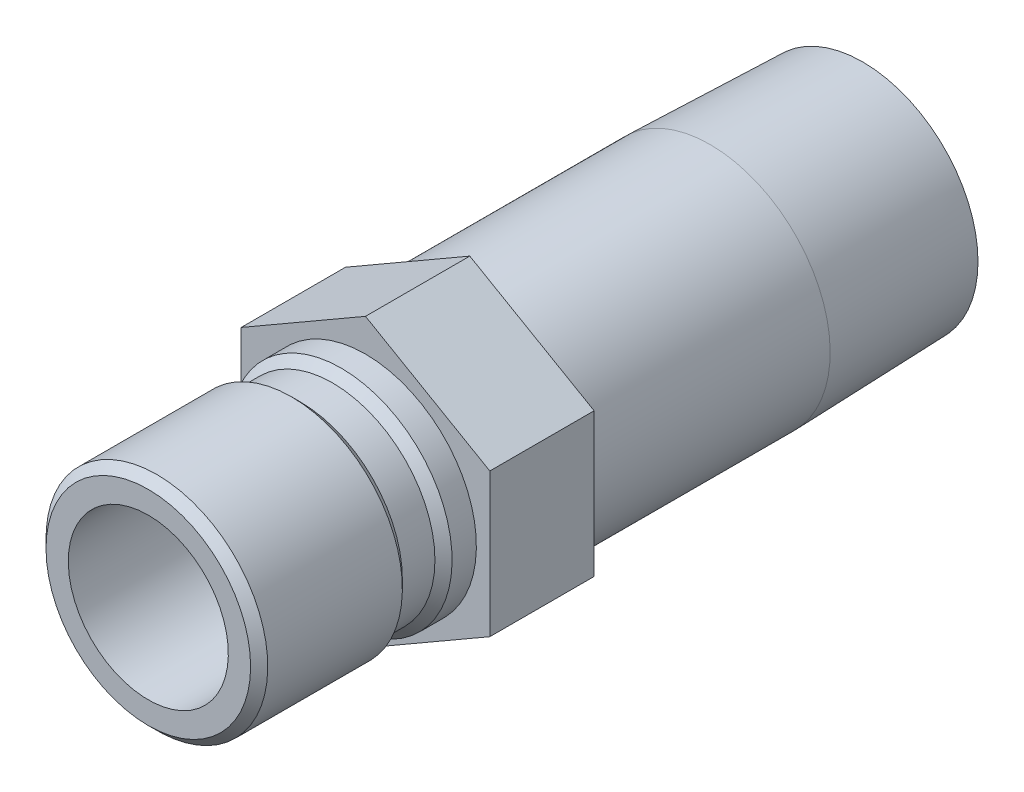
ISO-10303-21;
HEADER;
FILE_DESCRIPTION(('STEP AP214'),'2;1');
FILE_NAME('part.step','',(''),(''),'','','');
FILE_SCHEMA(('AUTOMOTIVE_DESIGN { 1 0 10303 214 1 1 1 1 }'));
ENDSEC;
DATA;
#1=APPLICATION_CONTEXT('core data for automotive mechanical design processes');
#2=APPLICATION_PROTOCOL_DEFINITION('international standard','automotive_design',2000,#1);
#3=PRODUCT_CONTEXT('',#1,'mechanical');
#4=PRODUCT('Part','Part','',(#3));
#5=PRODUCT_RELATED_PRODUCT_CATEGORY('part','',(#4));
#6=PRODUCT_DEFINITION_FORMATION('','',#4);
#7=PRODUCT_DEFINITION_CONTEXT('part definition',#1,'design');
#8=PRODUCT_DEFINITION('design','',#6,#7);
#9=PRODUCT_DEFINITION_SHAPE('','',#8);
#10=(LENGTH_UNIT() NAMED_UNIT(*) SI_UNIT(.MILLI.,.METRE.));
#11=(NAMED_UNIT(*) PLANE_ANGLE_UNIT() SI_UNIT($,.RADIAN.));
#12=(NAMED_UNIT(*) SI_UNIT($,.STERADIAN.) SOLID_ANGLE_UNIT());
#13=UNCERTAINTY_MEASURE_WITH_UNIT(LENGTH_MEASURE(1.E-05),#10,'distance_accuracy_value','');
#14=(GEOMETRIC_REPRESENTATION_CONTEXT(3) GLOBAL_UNCERTAINTY_ASSIGNED_CONTEXT((#13)) GLOBAL_UNIT_ASSIGNED_CONTEXT((#10,
#11,#12)) REPRESENTATION_CONTEXT('',''));
#15=CARTESIAN_POINT('',(0.,0.,0.));
#16=DIRECTION('',(0.,0.,1.));
#17=DIRECTION('',(1.,0.,0.));
#18=AXIS2_PLACEMENT_3D('',#15,#16,#17);
#19=CARTESIAN_POINT('',(0.,0.,0.));
#20=DIRECTION('',(0.,0.,-1.));
#21=DIRECTION('',(0.,1.,0.));
#22=AXIS2_PLACEMENT_3D('',#19,#20,#21);
#23=CYLINDRICAL_SURFACE('',#22,7.112);
#24=CARTESIAN_POINT('',(0.,0.,1.524));
#25=DIRECTION('',(0.,0.,-1.));
#26=DIRECTION('',(0.,1.,0.));
#27=AXIS2_PLACEMENT_3D('',#24,#25,#26);
#28=CIRCLE('',#27,7.112);
#29=CARTESIAN_POINT('',(0.,7.112,1.524));
#30=VERTEX_POINT('',#29);
#31=EDGE_CURVE('E147',#30,#30,#28,.T.);
#32=ORIENTED_EDGE('',*,*,#31,.T.);
#33=EDGE_LOOP('',(#32));
#34=FACE_BOUND('',#33,.T.);
#35=CARTESIAN_POINT('',(0.,0.,19.304));
#36=DIRECTION('',(0.,0.,-1.));
#37=DIRECTION('',(0.,1.,0.));
#38=AXIS2_PLACEMENT_3D('',#35,#36,#37);
#39=CIRCLE('',#38,7.112);
#40=CARTESIAN_POINT('',(0.,7.112,19.304));
#41=VERTEX_POINT('',#40);
#42=EDGE_CURVE('E42',#41,#41,#39,.T.);
#43=ORIENTED_EDGE('',*,*,#42,.F.);
#44=EDGE_LOOP('',(#43));
#45=FACE_BOUND('',#44,.T.);
#46=ADVANCED_FACE('F33',(#34,#45),#23,.F.);
#47=CARTESIAN_POINT('',(0.,7.112,19.304));
#48=DIRECTION('',(0.,0.,1.));
#49=DIRECTION('',(0.,-1.,0.));
#50=AXIS2_PLACEMENT_3D('',#47,#48,#49);
#51=PLANE('',#50);
#52=ORIENTED_EDGE('',*,*,#42,.T.);
#53=EDGE_LOOP('',(#52));
#54=FACE_BOUND('',#53,.T.);
#55=CARTESIAN_POINT('',(0.,0.,19.304));
#56=DIRECTION('',(0.,0.,-1.));
#57=DIRECTION('',(0.,1.,0.));
#58=AXIS2_PLACEMENT_3D('',#55,#56,#57);
#59=CIRCLE('',#58,9.0932);
#60=CARTESIAN_POINT('',(0.,9.0932,19.304));
#61=VERTEX_POINT('',#60);
#62=EDGE_CURVE('E180',#61,#61,#59,.T.);
#63=ORIENTED_EDGE('',*,*,#62,.F.);
#64=EDGE_LOOP('',(#63));
#65=FACE_BOUND('',#64,.T.);
#66=ADVANCED_FACE('F186',(#54,#65),#51,.T.);
#67=CARTESIAN_POINT('',(0.,0.,18.542));
#68=DIRECTION('',(0.,0.,-1.));
#69=DIRECTION('',(0.,1.,0.));
#70=AXIS2_PLACEMENT_3D('',#67,#68,#69);
#71=CONICAL_SURFACE('',#70,9.8552,0.785398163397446);
#72=ORIENTED_EDGE('',*,*,#62,.T.);
#73=EDGE_LOOP('',(#72));
#74=FACE_BOUND('',#73,.T.);
#75=CARTESIAN_POINT('',(0.,0.,18.542));
#76=DIRECTION('',(0.,0.,-1.));
#77=DIRECTION('',(0.,1.,0.));
#78=AXIS2_PLACEMENT_3D('',#75,#76,#77);
#79=CIRCLE('',#78,9.8552);
#80=CARTESIAN_POINT('',(0.,9.8552,18.542));
#81=VERTEX_POINT('',#80);
#82=EDGE_CURVE('E177',#81,#81,#79,.T.);
#83=ORIENTED_EDGE('',*,*,#82,.F.);
#84=EDGE_LOOP('',(#83));
#85=FACE_BOUND('',#84,.T.);
#86=ADVANCED_FACE('F194',(#74,#85),#71,.T.);
#87=CARTESIAN_POINT('',(0.,0.,0.));
#88=DIRECTION('',(0.,0.,-1.));
#89=DIRECTION('',(0.,1.,0.));
#90=AXIS2_PLACEMENT_3D('',#87,#88,#89);
#91=CYLINDRICAL_SURFACE('',#90,9.8552);
#92=ORIENTED_EDGE('',*,*,#82,.T.);
#93=EDGE_LOOP('',(#92));
#94=FACE_BOUND('',#93,.T.);
#95=CARTESIAN_POINT('',(0.,0.,6.5786));
#96=DIRECTION('',(0.,0.,-1.));
#97=DIRECTION('',(0.,1.,0.));
#98=AXIS2_PLACEMENT_3D('',#95,#96,#97);
#99=CIRCLE('',#98,9.8552);
#100=CARTESIAN_POINT('',(0.,9.8552,6.5786));
#101=VERTEX_POINT('',#100);
#102=EDGE_CURVE('E174',#101,#101,#99,.T.);
#103=ORIENTED_EDGE('',*,*,#102,.F.);
#104=EDGE_LOOP('',(#103));
#105=FACE_BOUND('',#104,.T.);
#106=ADVANCED_FACE('F249',(#94,#105),#91,.T.);
#107=CARTESIAN_POINT('',(0.,0.,5.8166));
#108=DIRECTION('',(0.,0.,1.));
#109=DIRECTION('',(0.,-1.,0.));
#110=AXIS2_PLACEMENT_3D('',#107,#108,#109);
#111=CONICAL_SURFACE('',#110,9.0932,0.785398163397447);
#112=ORIENTED_EDGE('',*,*,#102,.T.);
#113=EDGE_LOOP('',(#112));
#114=FACE_BOUND('',#113,.T.);
#115=CARTESIAN_POINT('',(0.,0.,5.8166));
#116=DIRECTION('',(0.,0.,-1.));
#117=DIRECTION('',(0.,1.,0.));
#118=AXIS2_PLACEMENT_3D('',#115,#116,#117);
#119=CIRCLE('',#118,9.0932);
#120=CARTESIAN_POINT('',(0.,9.0932,5.8166));
#121=VERTEX_POINT('',#120);
#122=EDGE_CURVE('E171',#121,#121,#119,.T.);
#123=ORIENTED_EDGE('',*,*,#122,.F.);
#124=EDGE_LOOP('',(#123));
#125=FACE_BOUND('',#124,.T.);
#126=ADVANCED_FACE('F245',(#114,#125),#111,.T.);
#127=CARTESIAN_POINT('',(0.,0.,0.));
#128=DIRECTION('',(0.,0.,-1.));
#129=DIRECTION('',(0.,1.,0.));
#130=AXIS2_PLACEMENT_3D('',#127,#128,#129);
#131=CYLINDRICAL_SURFACE('',#130,9.0932);
#132=ORIENTED_EDGE('',*,*,#122,.T.);
#133=EDGE_LOOP('',(#132));
#134=FACE_BOUND('',#133,.T.);
#135=CARTESIAN_POINT('',(0.,0.,2.921));
#136=DIRECTION('',(0.,0.,-1.));
#137=DIRECTION('',(0.,1.,0.));
#138=AXIS2_PLACEMENT_3D('',#135,#136,#137);
#139=CIRCLE('',#138,9.0932);
#140=CARTESIAN_POINT('',(0.,9.0932,2.921));
#141=VERTEX_POINT('',#140);
#142=EDGE_CURVE('E168',#141,#141,#139,.T.);
#143=ORIENTED_EDGE('',*,*,#142,.F.);
#144=EDGE_LOOP('',(#143));
#145=FACE_BOUND('',#144,.T.);
#146=ADVANCED_FACE('F241',(#134,#145),#131,.T.);
#147=CARTESIAN_POINT('',(0.,0.,2.159));
#148=DIRECTION('',(0.,0.,-1.));
#149=DIRECTION('',(0.,1.,0.));
#150=AXIS2_PLACEMENT_3D('',#147,#148,#149);
#151=CONICAL_SURFACE('',#150,9.8552,0.785398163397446);
#152=ORIENTED_EDGE('',*,*,#142,.T.);
#153=EDGE_LOOP('',(#152));
#154=FACE_BOUND('',#153,.T.);
#155=CARTESIAN_POINT('',(0.,0.,2.159));
#156=DIRECTION('',(0.,0.,-1.));
#157=DIRECTION('',(0.,1.,0.));
#158=AXIS2_PLACEMENT_3D('',#155,#156,#157);
#159=CIRCLE('',#158,9.8552);
#160=CARTESIAN_POINT('',(0.,9.8552,2.159));
#161=VERTEX_POINT('',#160);
#162=EDGE_CURVE('E165',#161,#161,#159,.T.);
#163=ORIENTED_EDGE('',*,*,#162,.F.);
#164=EDGE_LOOP('',(#163));
#165=FACE_BOUND('',#164,.T.);
#166=ADVANCED_FACE('F237',(#154,#165),#151,.T.);
#167=CARTESIAN_POINT('',(0.,0.,0.));
#168=DIRECTION('',(0.,0.,-1.));
#169=DIRECTION('',(0.,1.,0.));
#170=AXIS2_PLACEMENT_3D('',#167,#168,#169);
#171=CYLINDRICAL_SURFACE('',#170,9.8552);
#172=ORIENTED_EDGE('',*,*,#162,.T.);
#173=EDGE_LOOP('',(#172));
#174=FACE_BOUND('',#173,.T.);
#175=CARTESIAN_POINT('',(0.,0.,0.));
#176=DIRECTION('',(0.,0.,-1.));
#177=DIRECTION('',(0.,1.,0.));
#178=AXIS2_PLACEMENT_3D('',#175,#176,#177);
#179=CIRCLE('',#178,9.8552);
#180=CARTESIAN_POINT('',(0.,9.8552,0.));
#181=VERTEX_POINT('',#180);
#182=EDGE_CURVE('E162',#181,#181,#179,.T.);
#183=ORIENTED_EDGE('',*,*,#182,.F.);
#184=EDGE_LOOP('',(#183));
#185=FACE_BOUND('',#184,.T.);
#186=ADVANCED_FACE('F233',(#174,#185),#171,.T.);
#187=CARTESIAN_POINT('',(0.,9.8552,0.));
#188=DIRECTION('',(0.,0.,1.));
#189=DIRECTION('',(0.,-1.,0.));
#190=AXIS2_PLACEMENT_3D('',#187,#188,#189);
#191=PLANE('',#190);
#192=ORIENTED_EDGE('',*,*,#182,.T.);
#193=EDGE_LOOP('',(#192));
#194=FACE_BOUND('',#193,.T.);
#195=DIRECTION('',(-0.866025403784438,-0.5,0.));
#196=VECTOR('',#195,1.);
#197=CARTESIAN_POINT('',(0.,12.7582862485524,0.));
#198=LINE('',#197,#196);
#199=CARTESIAN_POINT('',(0.,12.7582862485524,0.));
#200=VERTEX_POINT('',#199);
#201=CARTESIAN_POINT('',(-11.049,6.37914312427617,0.));
#202=VERTEX_POINT('',#201);
#203=EDGE_CURVE('E121',#200,#202,#198,.T.);
#204=ORIENTED_EDGE('',*,*,#203,.T.);
#205=DIRECTION('',(0.,-1.,0.));
#206=VECTOR('',#205,1.);
#207=CARTESIAN_POINT('',(-11.049,6.37914312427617,0.));
#208=LINE('',#207,#206);
#209=CARTESIAN_POINT('',(-11.049,-6.37914312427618,0.));
#210=VERTEX_POINT('',#209);
#211=EDGE_CURVE('E124',#202,#210,#208,.T.);
#212=ORIENTED_EDGE('',*,*,#211,.T.);
#213=DIRECTION('',(0.866025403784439,-0.5,0.));
#214=VECTOR('',#213,1.);
#215=CARTESIAN_POINT('',(-11.049,-6.37914312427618,0.));
#216=LINE('',#215,#214);
#217=CARTESIAN_POINT('',(0.,-12.7582862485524,0.));
#218=VERTEX_POINT('',#217);
#219=EDGE_CURVE('E128',#210,#218,#216,.T.);
#220=ORIENTED_EDGE('',*,*,#219,.T.);
#221=DIRECTION('',(0.866025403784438,0.5,0.));
#222=VECTOR('',#221,1.);
#223=CARTESIAN_POINT('',(0.,-12.7582862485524,0.));
#224=LINE('',#223,#222);
#225=CARTESIAN_POINT('',(11.049,-6.37914312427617,0.));
#226=VERTEX_POINT('',#225);
#227=EDGE_CURVE('E131',#218,#226,#224,.T.);
#228=ORIENTED_EDGE('',*,*,#227,.T.);
#229=DIRECTION('',(0.,1.,0.));
#230=VECTOR('',#229,1.);
#231=CARTESIAN_POINT('',(11.049,-6.37914312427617,0.));
#232=LINE('',#231,#230);
#233=CARTESIAN_POINT('',(11.049,6.37914312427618,0.));
#234=VERTEX_POINT('',#233);
#235=EDGE_CURVE('E98',#226,#234,#232,.T.);
#236=ORIENTED_EDGE('',*,*,#235,.T.);
#237=DIRECTION('',(-0.866025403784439,0.5,0.));
#238=VECTOR('',#237,1.);
#239=CARTESIAN_POINT('',(11.049,6.37914312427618,0.));
#240=LINE('',#239,#238);
#241=EDGE_CURVE('E134',#234,#200,#240,.T.);
#242=ORIENTED_EDGE('',*,*,#241,.T.);
#243=EDGE_LOOP('',(#204,#212,#220,#228,#236,#242));
#244=FACE_BOUND('',#243,.T.);
#245=ADVANCED_FACE('F210',(#194,#244),#191,.T.);
#246=CARTESIAN_POINT('',(0.,0.,0.));
#247=DIRECTION('',(0.,0.,-1.));
#248=DIRECTION('',(0.,1.,0.));
#249=AXIS2_PLACEMENT_3D('',#246,#247,#248);
#250=CYLINDRICAL_SURFACE('',#249,7.8994);
#251=CARTESIAN_POINT('',(0.,0.,0.));
#252=DIRECTION('',(0.,0.,1.));
#253=DIRECTION('',(1.,0.,0.));
#254=AXIS2_PLACEMENT_3D('',#251,#252,#253);
#255=CIRCLE('',#254,7.8994);
#256=CARTESIAN_POINT('',(7.8994,0.,0.));
#257=VERTEX_POINT('',#256);
#258=EDGE_CURVE('E11',#257,#257,#255,.T.);
#259=ORIENTED_EDGE('',*,*,#258,.F.);
#260=EDGE_LOOP('',(#259));
#261=FACE_BOUND('',#260,.T.);
#262=CARTESIAN_POINT('',(0.,0.,1.10533199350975));
#263=DIRECTION('',(0.,0.,-1.));
#264=DIRECTION('',(0.,1.,0.));
#265=AXIS2_PLACEMENT_3D('',#262,#263,#264);
#266=CIRCLE('',#265,7.8994);
#267=CARTESIAN_POINT('',(0.,7.8994,1.10533199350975));
#268=VERTEX_POINT('',#267);
#269=EDGE_CURVE('E150',#268,#268,#266,.T.);
#270=ORIENTED_EDGE('',*,*,#269,.F.);
#271=EDGE_LOOP('',(#270));
#272=FACE_BOUND('',#271,.T.);
#273=ADVANCED_FACE('F200',(#261,#272),#250,.F.);
#274=CARTESIAN_POINT('',(0.,0.,1.524));
#275=DIRECTION('',(0.,0.,-1.));
#276=DIRECTION('',(0.,1.,0.));
#277=AXIS2_PLACEMENT_3D('',#274,#275,#276);
#278=CONICAL_SURFACE('',#277,7.112,1.08210413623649);
#279=ORIENTED_EDGE('',*,*,#269,.T.);
#280=EDGE_LOOP('',(#279));
#281=FACE_BOUND('',#280,.T.);
#282=ORIENTED_EDGE('',*,*,#31,.F.);
#283=EDGE_LOOP('',(#282));
#284=FACE_BOUND('',#283,.T.);
#285=ADVANCED_FACE('F197',(#281,#284),#278,.F.);
#286=CARTESIAN_POINT('',(-11.049,6.37914312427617,-9.271));
#287=DIRECTION('',(0.,0.,1.));
#288=DIRECTION('',(1.,0.,0.));
#289=AXIS2_PLACEMENT_3D('',#286,#287,#288);
#290=PLANE('',#289);
#291=CARTESIAN_POINT('',(0.,0.,-9.271));
#292=DIRECTION('',(0.,0.,1.));
#293=DIRECTION('',(1.,0.,0.));
#294=AXIS2_PLACEMENT_3D('',#291,#292,#293);
#295=CIRCLE('',#294,7.8994);
#296=CARTESIAN_POINT('',(7.8994,0.,-9.271));
#297=VERTEX_POINT('',#296);
#298=EDGE_CURVE('E36',#297,#297,#295,.T.);
#299=ORIENTED_EDGE('',*,*,#298,.F.);
#300=EDGE_LOOP('',(#299));
#301=FACE_BOUND('',#300,.T.);
#302=CARTESIAN_POINT('',(0.,0.,-9.271));
#303=DIRECTION('',(0.,0.,1.));
#304=DIRECTION('',(1.,0.,0.));
#305=AXIS2_PLACEMENT_3D('',#302,#303,#304);
#306=CIRCLE('',#305,7.112);
#307=CARTESIAN_POINT('',(7.112,0.,-9.271));
#308=VERTEX_POINT('',#307);
#309=EDGE_CURVE('E125',#308,#308,#306,.T.);
#310=ORIENTED_EDGE('',*,*,#309,.T.);
#311=EDGE_LOOP('',(#310));
#312=FACE_BOUND('',#311,.T.);
#313=ADVANCED_FACE('F199',(#301,#312),#290,.F.);
#314=CARTESIAN_POINT('',(0.,0.,-9.271));
#315=DIRECTION('',(0.,0.,1.));
#316=DIRECTION('',(1.,0.,0.));
#317=AXIS2_PLACEMENT_3D('',#314,#315,#316);
#318=CYLINDRICAL_SURFACE('',#317,7.112);
#319=ORIENTED_EDGE('',*,*,#309,.F.);
#320=EDGE_LOOP('',(#319));
#321=FACE_BOUND('',#320,.T.);
#322=CARTESIAN_POINT('',(0.,0.,0.));
#323=DIRECTION('',(0.,0.,1.));
#324=DIRECTION('',(1.,0.,0.));
#325=AXIS2_PLACEMENT_3D('',#322,#323,#324);
#326=CIRCLE('',#325,7.112);
#327=CARTESIAN_POINT('',(7.112,0.,0.));
#328=VERTEX_POINT('',#327);
#329=EDGE_CURVE('E443',#328,#328,#326,.T.);
#330=ORIENTED_EDGE('',*,*,#329,.T.);
#331=EDGE_LOOP('',(#330));
#332=FACE_BOUND('',#331,.T.);
#333=ADVANCED_FACE('F207',(#321,#332),#318,.F.);
#334=CARTESIAN_POINT('',(-11.049,6.37914312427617,0.));
#335=DIRECTION('',(0.,0.,1.));
#336=DIRECTION('',(1.,0.,0.));
#337=AXIS2_PLACEMENT_3D('',#334,#335,#336);
#338=PLANE('',#337);
#339=ORIENTED_EDGE('',*,*,#258,.T.);
#340=EDGE_LOOP('',(#339));
#341=FACE_BOUND('',#340,.T.);
#342=ORIENTED_EDGE('',*,*,#329,.F.);
#343=EDGE_LOOP('',(#342));
#344=FACE_BOUND('',#343,.T.);
#345=ADVANCED_FACE('F221',(#341,#344),#338,.T.);
#346=CARTESIAN_POINT('',(0.,10.244140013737,-44.196));
#347=DIRECTION('',(0.,0.,-1.));
#348=DIRECTION('',(0.,1.,0.));
#349=AXIS2_PLACEMENT_3D('',#346,#347,#348);
#350=PLANE('',#349);
#351=CARTESIAN_POINT('',(0.,0.,-44.196));
#352=DIRECTION('',(0.,0.,-1.));
#353=DIRECTION('',(0.,1.,0.));
#354=AXIS2_PLACEMENT_3D('',#351,#352,#353);
#355=CIRCLE('',#354,10.244140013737);
#356=CARTESIAN_POINT('',(0.,10.244140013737,-44.196));
#357=VERTEX_POINT('',#356);
#358=EDGE_CURVE('E156',#357,#357,#355,.T.);
#359=ORIENTED_EDGE('',*,*,#358,.T.);
#360=EDGE_LOOP('',(#359));
#361=FACE_BOUND('',#360,.T.);
#362=CARTESIAN_POINT('',(0.,0.,-44.196));
#363=DIRECTION('',(0.,0.,-1.));
#364=DIRECTION('',(0.,1.,0.));
#365=AXIS2_PLACEMENT_3D('',#362,#363,#364);
#366=CIRCLE('',#365,7.89939999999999);
#367=CARTESIAN_POINT('',(0.,7.8994,-44.196));
#368=VERTEX_POINT('',#367);
#369=EDGE_CURVE('E153',#368,#368,#366,.T.);
#370=ORIENTED_EDGE('',*,*,#369,.F.);
#371=EDGE_LOOP('',(#370));
#372=FACE_BOUND('',#371,.T.);
#373=ADVANCED_FACE('F218',(#361,#372),#350,.T.);
#374=ORIENTED_EDGE('',*,*,#369,.T.);
#375=EDGE_LOOP('',(#374));
#376=FACE_BOUND('',#375,.T.);
#377=ORIENTED_EDGE('',*,*,#298,.T.);
#378=EDGE_LOOP('',(#377));
#379=FACE_BOUND('',#378,.T.);
#380=ADVANCED_FACE('F213',(#376,#379),#250,.F.);
#381=CARTESIAN_POINT('',(0.,0.,-44.196));
#382=DIRECTION('',(0.,0.,1.));
#383=DIRECTION('',(0.,-1.,0.));
#384=AXIS2_PLACEMENT_3D('',#381,#382,#383);
#385=CONICAL_SURFACE('',#384,10.244140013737,0.0312396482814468);
#386=CARTESIAN_POINT('',(0.,0.,-30.6324));
#387=DIRECTION('',(0.,0.,-1.));
#388=DIRECTION('',(0.,1.,0.));
#389=AXIS2_PLACEMENT_3D('',#386,#387,#388);
#390=CIRCLE('',#389,10.668);
#391=CARTESIAN_POINT('',(0.,10.668,-30.6324));
#392=VERTEX_POINT('',#391);
#393=EDGE_CURVE('E159',#392,#392,#390,.T.);
#394=ORIENTED_EDGE('',*,*,#393,.T.);
#395=EDGE_LOOP('',(#394));
#396=FACE_BOUND('',#395,.T.);
#397=ORIENTED_EDGE('',*,*,#358,.F.);
#398=EDGE_LOOP('',(#397));
#399=FACE_BOUND('',#398,.T.);
#400=ADVANCED_FACE('F223',(#396,#399),#385,.T.);
#401=CARTESIAN_POINT('',(0.,0.,0.));
#402=DIRECTION('',(0.,0.,-1.));
#403=DIRECTION('',(0.,1.,0.));
#404=AXIS2_PLACEMENT_3D('',#401,#402,#403);
#405=CYLINDRICAL_SURFACE('',#404,10.668);
#406=ORIENTED_EDGE('',*,*,#393,.F.);
#407=EDGE_LOOP('',(#406));
#408=FACE_BOUND('',#407,.T.);
#409=CARTESIAN_POINT('',(0.,0.,-9.271));
#410=DIRECTION('',(0.,0.,1.));
#411=DIRECTION('',(1.,0.,0.));
#412=AXIS2_PLACEMENT_3D('',#409,#410,#411);
#413=CIRCLE('',#412,10.668);
#414=CARTESIAN_POINT('',(10.668,0.,-9.271));
#415=VERTEX_POINT('',#414);
#416=EDGE_CURVE('E144',#415,#415,#413,.F.);
#417=ORIENTED_EDGE('',*,*,#416,.T.);
#418=EDGE_LOOP('',(#417));
#419=FACE_BOUND('',#418,.T.);
#420=ADVANCED_FACE('F226',(#408,#419),#405,.T.);
#421=ORIENTED_EDGE('',*,*,#416,.F.);
#422=EDGE_LOOP('',(#421));
#423=FACE_BOUND('',#422,.T.);
#424=DIRECTION('',(-0.866025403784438,-0.5,0.));
#425=VECTOR('',#424,1.);
#426=CARTESIAN_POINT('',(0.,12.7582862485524,-9.271));
#427=LINE('',#426,#425);
#428=CARTESIAN_POINT('',(0.,12.7582862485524,-9.271));
#429=VERTEX_POINT('',#428);
#430=CARTESIAN_POINT('',(-11.049,6.37914312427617,-9.271));
#431=VERTEX_POINT('',#430);
#432=EDGE_CURVE('E137',#429,#431,#427,.T.);
#433=ORIENTED_EDGE('',*,*,#432,.F.);
#434=DIRECTION('',(-0.866025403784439,0.5,0.));
#435=VECTOR('',#434,1.);
#436=CARTESIAN_POINT('',(11.049,6.37914312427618,-9.271));
#437=LINE('',#436,#435);
#438=CARTESIAN_POINT('',(11.049,6.37914312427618,-9.271));
#439=VERTEX_POINT('',#438);
#440=EDGE_CURVE('E111',#439,#429,#437,.T.);
#441=ORIENTED_EDGE('',*,*,#440,.F.);
#442=DIRECTION('',(0.,1.,0.));
#443=VECTOR('',#442,1.);
#444=CARTESIAN_POINT('',(11.049,-6.37914312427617,-9.271));
#445=LINE('',#444,#443);
#446=CARTESIAN_POINT('',(11.049,-6.37914312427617,-9.271));
#447=VERTEX_POINT('',#446);
#448=EDGE_CURVE('E96',#447,#439,#445,.T.);
#449=ORIENTED_EDGE('',*,*,#448,.F.);
#450=DIRECTION('',(0.866025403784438,0.5,0.));
#451=VECTOR('',#450,1.);
#452=CARTESIAN_POINT('',(0.,-12.7582862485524,-9.271));
#453=LINE('',#452,#451);
#454=CARTESIAN_POINT('',(0.,-12.7582862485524,-9.271));
#455=VERTEX_POINT('',#454);
#456=EDGE_CURVE('E109',#455,#447,#453,.T.);
#457=ORIENTED_EDGE('',*,*,#456,.F.);
#458=DIRECTION('',(0.866025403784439,-0.5,0.));
#459=VECTOR('',#458,1.);
#460=CARTESIAN_POINT('',(-11.049,-6.37914312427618,-9.271));
#461=LINE('',#460,#459);
#462=CARTESIAN_POINT('',(-11.049,-6.37914312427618,-9.271));
#463=VERTEX_POINT('',#462);
#464=EDGE_CURVE('E114',#463,#455,#461,.T.);
#465=ORIENTED_EDGE('',*,*,#464,.F.);
#466=DIRECTION('',(0.,-1.,0.));
#467=VECTOR('',#466,1.);
#468=CARTESIAN_POINT('',(-11.049,6.37914312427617,-9.271));
#469=LINE('',#468,#467);
#470=EDGE_CURVE('E116',#431,#463,#469,.T.);
#471=ORIENTED_EDGE('',*,*,#470,.F.);
#472=EDGE_LOOP('',(#433,#441,#449,#457,#465,#471));
#473=FACE_BOUND('',#472,.T.);
#474=ADVANCED_FACE('F107',(#423,#473),#290,.F.);
#475=CARTESIAN_POINT('',(0.,12.7582862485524,-9.271));
#476=DIRECTION('',(-0.5,0.866025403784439,0.));
#477=DIRECTION('',(-0.866025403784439,-0.5,0.));
#478=AXIS2_PLACEMENT_3D('',#475,#476,#477);
#479=PLANE('',#478);
#480=ORIENTED_EDGE('',*,*,#203,.F.);
#481=DIRECTION('',(0.,0.,1.));
#482=VECTOR('',#481,1.);
#483=CARTESIAN_POINT('',(0.,12.7582862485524,-9.271));
#484=LINE('',#483,#482);
#485=EDGE_CURVE('E50',#429,#200,#484,.T.);
#486=ORIENTED_EDGE('',*,*,#485,.F.);
#487=ORIENTED_EDGE('',*,*,#432,.T.);
#488=DIRECTION('',(0.,0.,1.));
#489=VECTOR('',#488,1.);
#490=CARTESIAN_POINT('',(-11.049,6.37914312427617,-9.271));
#491=LINE('',#490,#489);
#492=EDGE_CURVE('E85',#431,#202,#491,.T.);
#493=ORIENTED_EDGE('',*,*,#492,.T.);
#494=EDGE_LOOP('',(#480,#486,#487,#493));
#495=FACE_BOUND('',#494,.T.);
#496=ADVANCED_FACE('F215',(#495),#479,.T.);
#497=CARTESIAN_POINT('',(11.049,6.37914312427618,-9.271));
#498=DIRECTION('',(0.5,0.866025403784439,0.));
#499=DIRECTION('',(-0.866025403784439,0.5,0.));
#500=AXIS2_PLACEMENT_3D('',#497,#498,#499);
#501=PLANE('',#500);
#502=ORIENTED_EDGE('',*,*,#241,.F.);
#503=DIRECTION('',(0.,0.,1.));
#504=VECTOR('',#503,1.);
#505=CARTESIAN_POINT('',(11.049,6.37914312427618,-9.271));
#506=LINE('',#505,#504);
#507=EDGE_CURVE('E73',#439,#234,#506,.T.);
#508=ORIENTED_EDGE('',*,*,#507,.F.);
#509=ORIENTED_EDGE('',*,*,#440,.T.);
#510=ORIENTED_EDGE('',*,*,#485,.T.);
#511=EDGE_LOOP('',(#502,#508,#509,#510));
#512=FACE_BOUND('',#511,.T.);
#513=ADVANCED_FACE('F276',(#512),#501,.T.);
#514=CARTESIAN_POINT('',(11.049,-6.37914312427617,-9.271));
#515=DIRECTION('',(1.,0.,0.));
#516=DIRECTION('',(0.,1.,0.));
#517=AXIS2_PLACEMENT_3D('',#514,#515,#516);
#518=PLANE('',#517);
#519=ORIENTED_EDGE('',*,*,#235,.F.);
#520=DIRECTION('',(0.,0.,1.));
#521=VECTOR('',#520,1.);
#522=CARTESIAN_POINT('',(11.049,-6.37914312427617,-9.271));
#523=LINE('',#522,#521);
#524=EDGE_CURVE('E93',#447,#226,#523,.T.);
#525=ORIENTED_EDGE('',*,*,#524,.F.);
#526=ORIENTED_EDGE('',*,*,#448,.T.);
#527=ORIENTED_EDGE('',*,*,#507,.T.);
#528=EDGE_LOOP('',(#519,#525,#526,#527));
#529=FACE_BOUND('',#528,.T.);
#530=ADVANCED_FACE('F95',(#529),#518,.T.);
#531=CARTESIAN_POINT('',(0.,-12.7582862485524,-9.271));
#532=DIRECTION('',(0.5,-0.866025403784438,0.));
#533=DIRECTION('',(0.866025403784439,0.5,0.));
#534=AXIS2_PLACEMENT_3D('',#531,#532,#533);
#535=PLANE('',#534);
#536=ORIENTED_EDGE('',*,*,#227,.F.);
#537=DIRECTION('',(0.,0.,1.));
#538=VECTOR('',#537,1.);
#539=CARTESIAN_POINT('',(0.,-12.7582862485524,-9.271));
#540=LINE('',#539,#538);
#541=EDGE_CURVE('E103',#455,#218,#540,.T.);
#542=ORIENTED_EDGE('',*,*,#541,.F.);
#543=ORIENTED_EDGE('',*,*,#456,.T.);
#544=ORIENTED_EDGE('',*,*,#524,.T.);
#545=EDGE_LOOP('',(#536,#542,#543,#544));
#546=FACE_BOUND('',#545,.T.);
#547=ADVANCED_FACE('F113',(#546),#535,.T.);
#548=CARTESIAN_POINT('',(-11.049,-6.37914312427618,-9.271));
#549=DIRECTION('',(-0.5,-0.866025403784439,0.));
#550=DIRECTION('',(0.866025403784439,-0.5,0.));
#551=AXIS2_PLACEMENT_3D('',#548,#549,#550);
#552=PLANE('',#551);
#553=ORIENTED_EDGE('',*,*,#219,.F.);
#554=DIRECTION('',(0.,0.,1.));
#555=VECTOR('',#554,1.);
#556=CARTESIAN_POINT('',(-11.049,-6.37914312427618,-9.271));
#557=LINE('',#556,#555);
#558=EDGE_CURVE('E141',#463,#210,#557,.T.);
#559=ORIENTED_EDGE('',*,*,#558,.F.);
#560=ORIENTED_EDGE('',*,*,#464,.T.);
#561=ORIENTED_EDGE('',*,*,#541,.T.);
#562=EDGE_LOOP('',(#553,#559,#560,#561));
#563=FACE_BOUND('',#562,.T.);
#564=ADVANCED_FACE('F275',(#563),#552,.T.);
#565=CARTESIAN_POINT('',(-11.049,6.37914312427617,-9.271));
#566=DIRECTION('',(-1.,0.,0.));
#567=DIRECTION('',(0.,0.,1.));
#568=AXIS2_PLACEMENT_3D('',#565,#566,#567);
#569=PLANE('',#568);
#570=ORIENTED_EDGE('',*,*,#211,.F.);
#571=ORIENTED_EDGE('',*,*,#492,.F.);
#572=ORIENTED_EDGE('',*,*,#470,.T.);
#573=ORIENTED_EDGE('',*,*,#558,.T.);
#574=EDGE_LOOP('',(#570,#571,#572,#573));
#575=FACE_BOUND('',#574,.T.);
#576=ADVANCED_FACE('F272',(#575),#569,.T.);
#577=CLOSED_SHELL('',(#46,#66,#86,#106,#126,#146,#166,#186,#245,#273,#285,#313,#333,#345,#373,
#380,#400,#420,#474,#496,#513,#530,#547,#564,#576));
#578=MANIFOLD_SOLID_BREP('B2',#577);
#579=ADVANCED_BREP_SHAPE_REPRESENTATION('',(#18,#578),#14);
#580=SHAPE_DEFINITION_REPRESENTATION(#9,#579);
ENDSEC;
END-ISO-10303-21;
